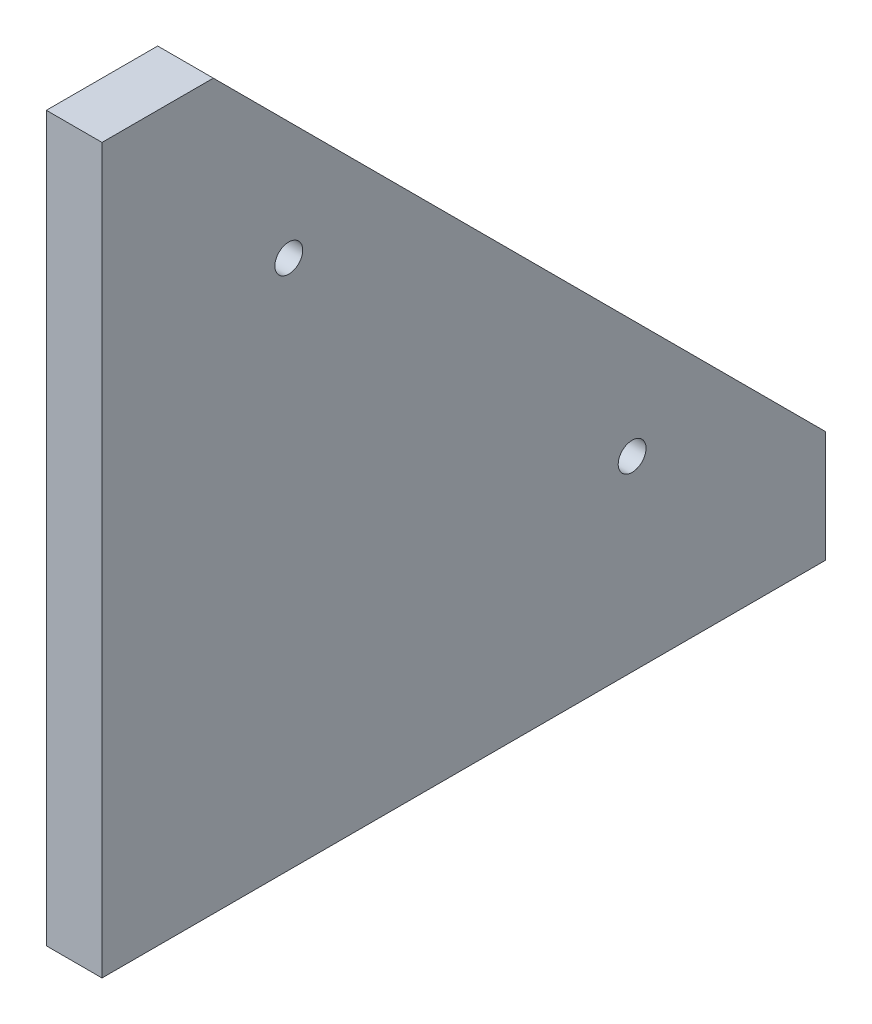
from build123d import *

# Parameters (mm, degrees)
BOSS_EXTRUDE1_DEPTH            = 2.5
F_2_5MM_DOWEL_HOLE1_AT_2_COUNT = 2
F_2_5MM_DOWEL_HOLE1_AT_2_PITCH = 43.617065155


with BuildPart() as part:
    # Sketch1 → Boss-Extrude1 (new, symmetric)
    with BuildSketch(Plane(origin=(0, 0, 0), x_dir=(0, 0, -1), z_dir=(1, 0, 0))):
        Polygon((0, 65), (0, 0), (65, 0), (65, 10), (10, 65), align=None)
    extrude(amount=BOSS_EXTRUDE1_DEPTH, both=True)

    # Sketch3 → 2.5mm Dowel Hole1 (revolve, cut)
    with BuildSketch(Plane(origin=(2.5, 47.617660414, -16.775737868), x_dir=(0, 0, -1), z_dir=(0, 1, 0))):
        Polygon((0, 0), (0, 5), (1.275, 5), (1.25, 4.975), (1.25, 0), align=None)
    f_2_5mm_dowel_hole1 = revolve(axis=Axis((8.85, 47.617660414, -16.775737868), (-1, 0, 0)), mode=Mode.SUBTRACT)

    # 2.5mm Dowel Hole1 at 2: 2.5mm Dowel Hole1 ×2
    with Locations(*[Vector(0, -0.7071067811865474, -0.7071067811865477) * (i * F_2_5MM_DOWEL_HOLE1_AT_2_PITCH) for i in range(1, F_2_5MM_DOWEL_HOLE1_AT_2_COUNT)]):
        add(f_2_5mm_dowel_hole1, mode=Mode.SUBTRACT)


solid = part.part
